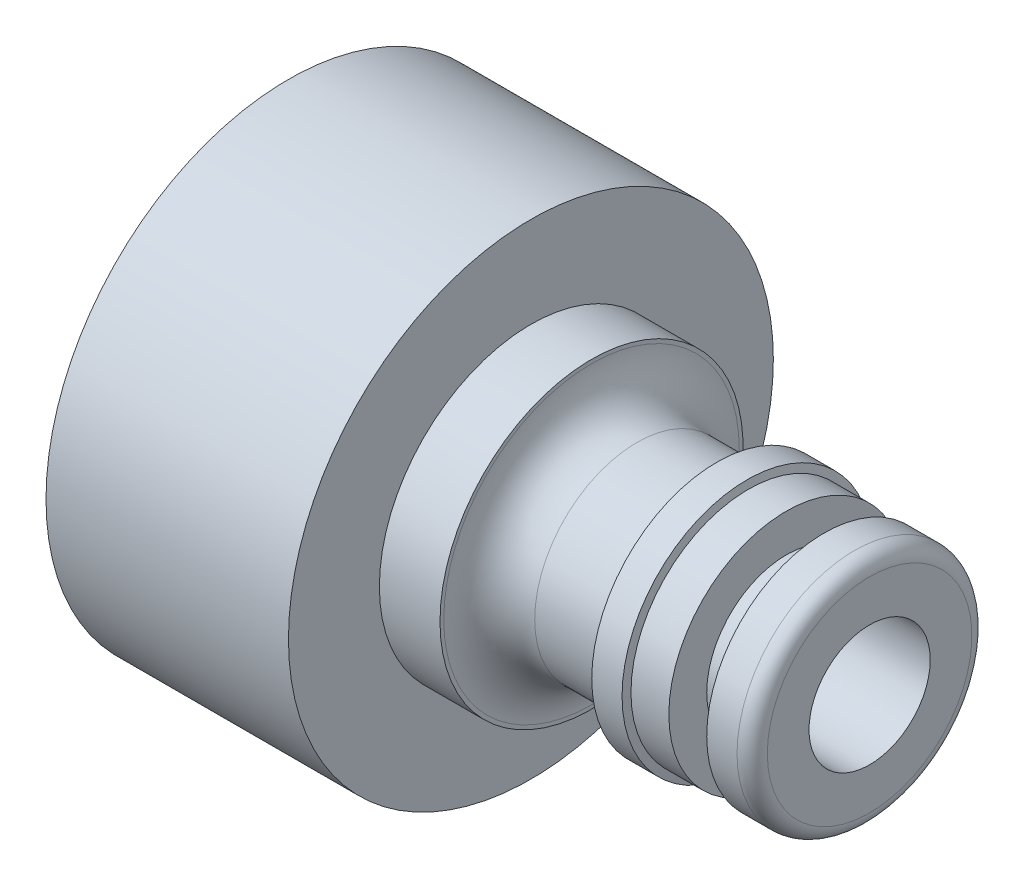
from build123d import *

# Parameters (mm, degrees)
ESQUISSE2_R             = 4
ENL_V_MAT_EXTRU_1_DEPTH = 45.530058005
ESQUISSE3_R             = 12.25
ENL_V_MAT_EXTRU_2_DEPTH = 12


with BuildPart() as part:
    # Esquisse1 → R_volution1 (revolve)
    with BuildSketch(Plane.XY, mode=Mode.PRIVATE) as r_volution1_sk:
        with BuildLine():
            Line((0, 0), (0, 16))
            Line((0, 16), (16, 16))
            Line((16, 16), (16, 10))
            Line((16, 10), (20, 10))
            Line((20, 10), (20, 9.75))
            ThreePointArc((20, 9.75), (20.878679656, 7.628679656), (23, 6.75))
            Line((23, 6.75), (28, 6.75))
            Line((28, 6.75), (28.264490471, 8.25))
            Line((28.264490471, 8.25), (30.264490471, 8.25))
            Line((30.264490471, 8.25), (30.352653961, 7.75))
            Line((30.352653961, 7.75), (32.852653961, 7.75))
            Line((32.852653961, 7.75), (32.852653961, 5.25))
            Line((32.852653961, 5.25), (35.352653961, 5.25))
            Line((35.352653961, 5.25), (35.352653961, 7.75))
            Line((35.352653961, 7.75), (37.352653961, 7.75))
            ThreePointArc((37.352653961, 7.75), (38.059760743, 7.457106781), (38.352653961, 6.75))
            Line((38.352653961, 6.75), (38.352653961, 0))
            Line((38.352653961, 0), (0, 0))
        make_face()
    revolve(r_volution1_sk.sketch.rotate(Axis((0, 0, 0), (1, 0, 0)), 90), axis=Axis((0, 0, 0), (1, 0, 0)))

    # Esquisse2 → Enl_v. mat.-Extru.1 (cut, through all)
    with BuildSketch(Plane(origin=(38.352653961, 0, 0), x_dir=(0, 0, -1), z_dir=(1, 0, 0))):
        Circle(ESQUISSE2_R)
    extrude(amount=-ENL_V_MAT_EXTRU_1_DEPTH, mode=Mode.SUBTRACT)

    # Esquisse3 → Enl_v. mat.-Extru.2 (cut)
    with BuildSketch(Plane.ZY):
        Circle(ESQUISSE3_R)
    extrude(amount=-ENL_V_MAT_EXTRU_2_DEPTH, mode=Mode.SUBTRACT)


solid = part.part
